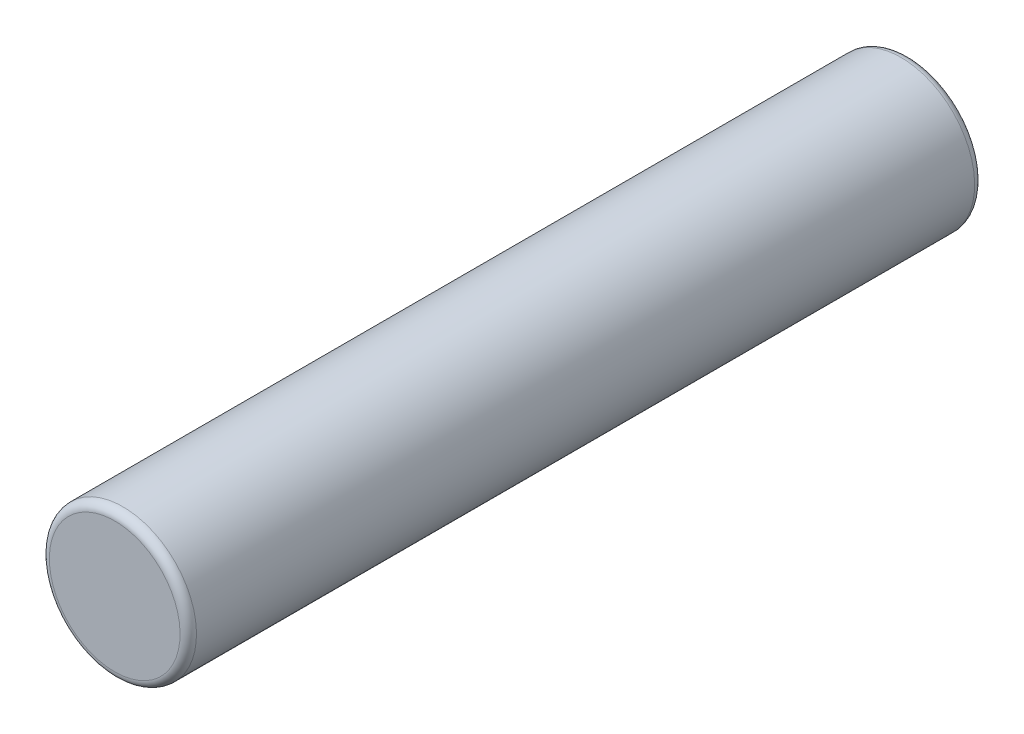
from build123d import *


with BuildPart() as part:
    # Sketch 1 → Revolve 1 (revolve)
    with BuildSketch(Plane(origin=(0, 0, 0), x_dir=(0, 0, -1), z_dir=(1, 0, 0)), mode=Mode.PRIVATE) as revolve_1_sk:
        with BuildLine():
            Line((-19.2405, 0), (19.2405, 0))
            Line((19.2405, 0), (19.2405, 3.165475))
            ThreePointArc((19.2405, 3.165475), (19.124258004, 3.446108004), (18.843625, 3.56235))
            Line((18.843625, 3.56235), (-18.843625, 3.56235))
            ThreePointArc((-18.843625, 3.56235), (-19.124258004, 3.446108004), (-19.2405, 3.165475))
            Line((-19.2405, 3.165475), (-19.2405, 0))
        make_face()
    revolve(revolve_1_sk.sketch.rotate(Axis((0, 0, 19.2405), (0, 0, -1)), 180), axis=Axis((0, 0, 19.2405), (0, 0, -1)))


solid = part.part
